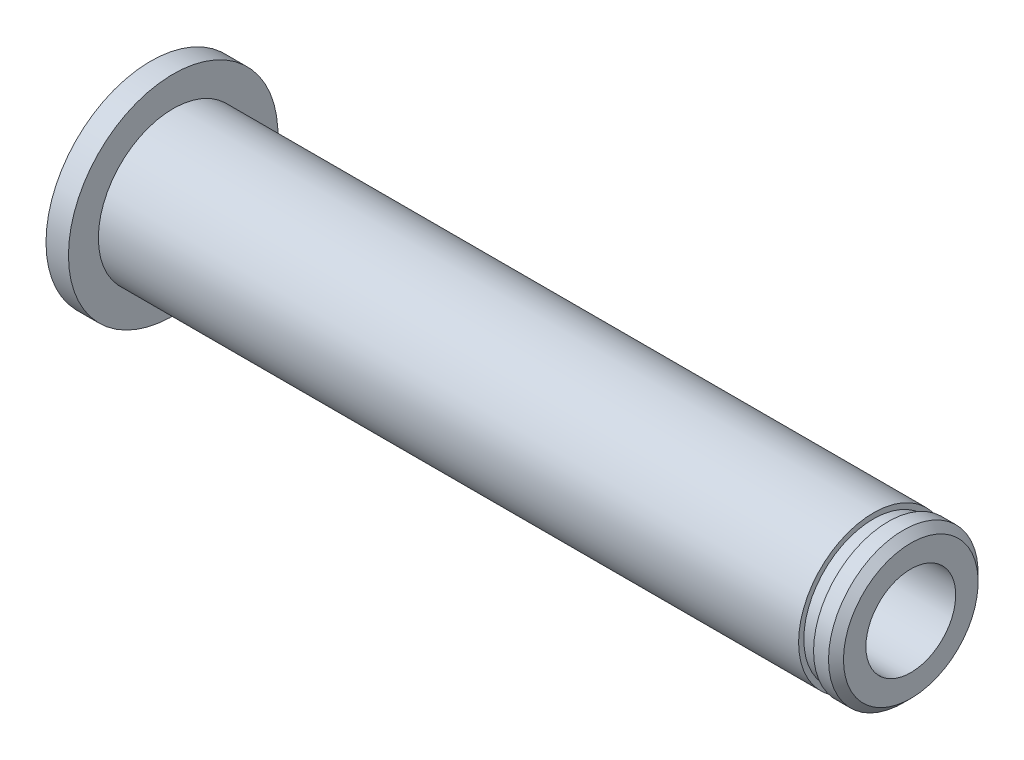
from build123d import *


with BuildPart() as part:
    # Esquisse1 → R_volution1 (revolve)
    with BuildSketch(Plane.XY, mode=Mode.PRIVATE) as r_volution1_sk:
        Polygon((0, 3), (0, 7), (1.5, 7), (1.5, 5), (48.3, 5), (48.3, 4.65), (49.3, 4.65), (49.3, 5), (50.3, 5), (50.8, 4.5), (50.8, 3), align=None)
    revolve(r_volution1_sk.sketch.rotate(Axis((0, 0, 0), (1, 0, 0)), 90), axis=Axis((0, 0, 0), (1, 0, 0)))


solid = part.part
